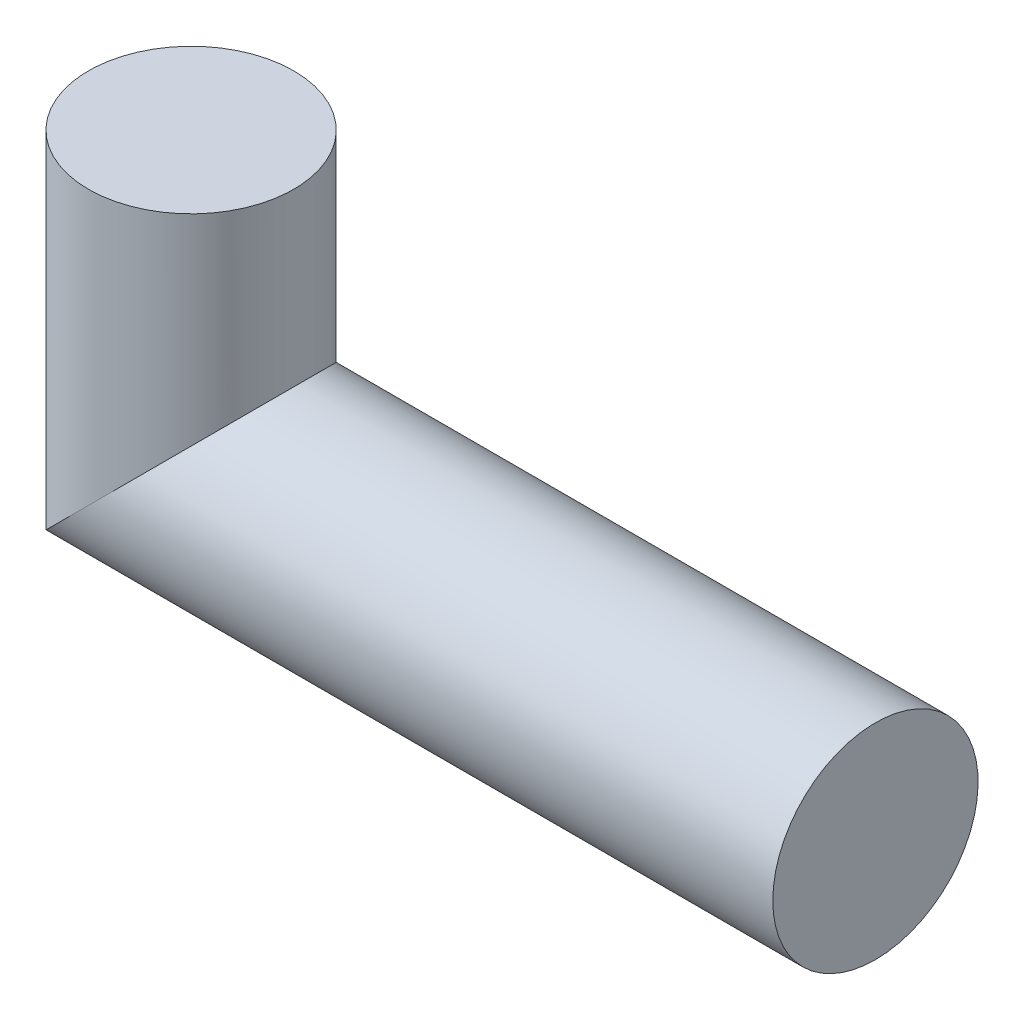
ISO-10303-21;
HEADER;
FILE_DESCRIPTION(('STEP AP214'),'2;1');
FILE_NAME('part.step','',(''),(''),'','','');
FILE_SCHEMA(('AUTOMOTIVE_DESIGN { 1 0 10303 214 1 1 1 1 }'));
ENDSEC;
DATA;
#1=APPLICATION_CONTEXT('core data for automotive mechanical design processes');
#2=APPLICATION_PROTOCOL_DEFINITION('international standard','automotive_design',2000,#1);
#3=PRODUCT_CONTEXT('',#1,'mechanical');
#4=PRODUCT('Part','Part','',(#3));
#5=PRODUCT_RELATED_PRODUCT_CATEGORY('part','',(#4));
#6=PRODUCT_DEFINITION_FORMATION('','',#4);
#7=PRODUCT_DEFINITION_CONTEXT('part definition',#1,'design');
#8=PRODUCT_DEFINITION('design','',#6,#7);
#9=PRODUCT_DEFINITION_SHAPE('','',#8);
#10=(LENGTH_UNIT() NAMED_UNIT(*) SI_UNIT(.MILLI.,.METRE.));
#11=(NAMED_UNIT(*) PLANE_ANGLE_UNIT() SI_UNIT($,.RADIAN.));
#12=(NAMED_UNIT(*) SI_UNIT($,.STERADIAN.) SOLID_ANGLE_UNIT());
#13=UNCERTAINTY_MEASURE_WITH_UNIT(LENGTH_MEASURE(1.E-05),#10,'distance_accuracy_value','');
#14=(GEOMETRIC_REPRESENTATION_CONTEXT(3) GLOBAL_UNCERTAINTY_ASSIGNED_CONTEXT((#13)) GLOBAL_UNIT_ASSIGNED_CONTEXT((#10,
#11,#12)) REPRESENTATION_CONTEXT('',''));
#15=CARTESIAN_POINT('',(0.,0.,0.));
#16=DIRECTION('',(0.,0.,1.));
#17=DIRECTION('',(1.,0.,0.));
#18=AXIS2_PLACEMENT_3D('',#15,#16,#17);
#19=CARTESIAN_POINT('',(127.,-50.8,0.));
#20=DIRECTION('',(-1.,0.,0.));
#21=DIRECTION('',(0.,0.,1.));
#22=AXIS2_PLACEMENT_3D('',#19,#20,#21);
#23=PLANE('',#22);
#24=CARTESIAN_POINT('',(127.,-50.8,0.));
#25=DIRECTION('',(-1.,0.,0.));
#26=DIRECTION('',(0.,0.,1.));
#27=AXIS2_PLACEMENT_3D('',#24,#25,#26);
#28=CIRCLE('',#27,19.05);
#29=CARTESIAN_POINT('',(127.,-50.8,19.05));
#30=VERTEX_POINT('',#29);
#31=EDGE_CURVE('E40',#30,#30,#28,.T.);
#32=ORIENTED_EDGE('',*,*,#31,.F.);
#33=EDGE_LOOP('',(#32));
#34=FACE_BOUND('',#33,.T.);
#35=ADVANCED_FACE('F37',(#34),#23,.F.);
#36=CARTESIAN_POINT('',(0.,0.,0.));
#37=DIRECTION('',(0.,1.,0.));
#38=DIRECTION('',(0.,0.,1.));
#39=AXIS2_PLACEMENT_3D('',#36,#37,#38);
#40=PLANE('',#39);
#41=CARTESIAN_POINT('',(0.,0.,0.));
#42=DIRECTION('',(0.,1.,0.));
#43=DIRECTION('',(0.,0.,1.));
#44=AXIS2_PLACEMENT_3D('',#41,#42,#43);
#45=CIRCLE('',#44,19.05);
#46=CARTESIAN_POINT('',(0.,0.,19.05));
#47=VERTEX_POINT('',#46);
#48=EDGE_CURVE('E45',#47,#47,#45,.T.);
#49=ORIENTED_EDGE('',*,*,#48,.T.);
#50=EDGE_LOOP('',(#49));
#51=FACE_BOUND('',#50,.T.);
#52=ADVANCED_FACE('F60',(#51),#40,.T.);
#53=CARTESIAN_POINT('',(-42.01,-50.8,0.));
#54=DIRECTION('',(1.,0.,0.));
#55=DIRECTION('',(0.,0.,-1.));
#56=AXIS2_PLACEMENT_3D('',#53,#54,#55);
#57=CYLINDRICAL_SURFACE('',#56,19.05);
#58=CARTESIAN_POINT('',(0.,-50.8,0.));
#59=DIRECTION('',(0.707106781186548,-0.707106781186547,0.));
#60=DIRECTION('',(-0.707106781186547,-0.707106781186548,0.));
#61=AXIS2_PLACEMENT_3D('',#58,#59,#60);
#62=ELLIPSE('',#61,26.9407683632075,19.05);
#63=CARTESIAN_POINT('',(-19.05,-69.85,0.));
#64=VERTEX_POINT('',#63);
#65=EDGE_CURVE('E10',#64,#64,#62,.T.);
#66=ORIENTED_EDGE('',*,*,#65,.T.);
#67=EDGE_LOOP('',(#66));
#68=FACE_BOUND('',#67,.T.);
#69=ORIENTED_EDGE('',*,*,#31,.T.);
#70=EDGE_LOOP('',(#69));
#71=FACE_BOUND('',#70,.T.);
#72=ADVANCED_FACE('F57',(#68,#71),#57,.T.);
#73=CARTESIAN_POINT('',(0.,0.,0.));
#74=DIRECTION('',(0.,-1.,0.));
#75=DIRECTION('',(1.,0.,0.));
#76=AXIS2_PLACEMENT_3D('',#73,#74,#75);
#77=CYLINDRICAL_SURFACE('',#76,19.05);
#78=ORIENTED_EDGE('',*,*,#48,.F.);
#79=EDGE_LOOP('',(#78));
#80=FACE_BOUND('',#79,.T.);
#81=ORIENTED_EDGE('',*,*,#65,.F.);
#82=EDGE_LOOP('',(#81));
#83=FACE_BOUND('',#82,.T.);
#84=ADVANCED_FACE('F64',(#80,#83),#77,.T.);
#85=CLOSED_SHELL('',(#35,#52,#72,#84));
#86=MANIFOLD_SOLID_BREP('B2',#85);
#87=ADVANCED_BREP_SHAPE_REPRESENTATION('',(#18,#86),#14);
#88=SHAPE_DEFINITION_REPRESENTATION(#9,#87);
ENDSEC;
END-ISO-10303-21;
